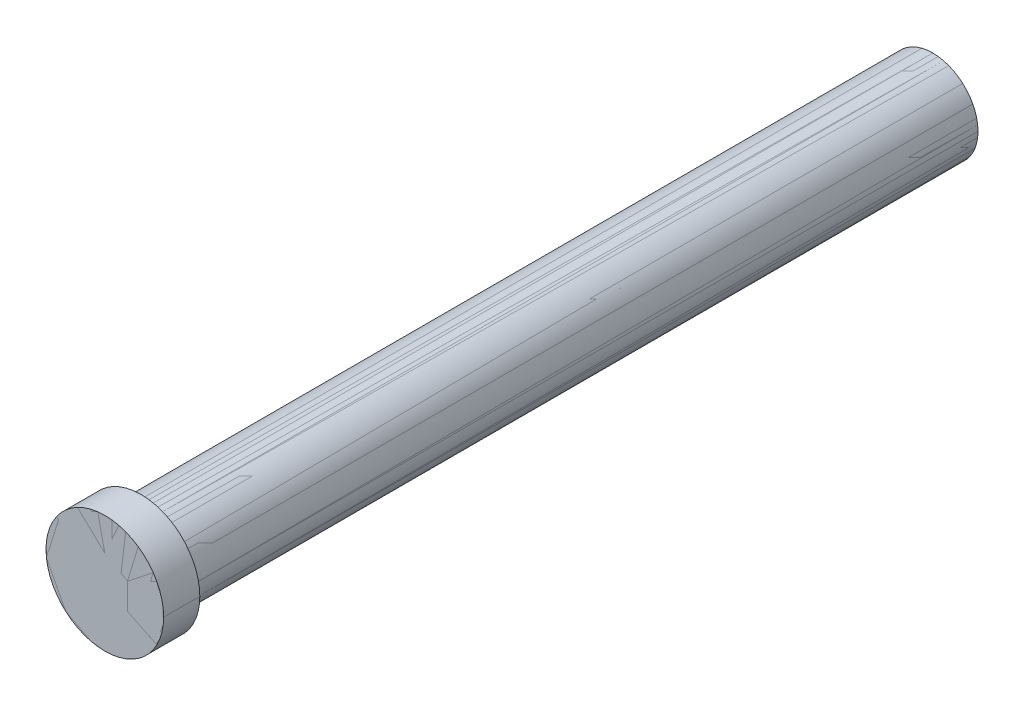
ISO-10303-21;
HEADER;
FILE_DESCRIPTION(('STEP AP214'),'2;1');
FILE_NAME('part.step','',(''),(''),'','','');
FILE_SCHEMA(('AUTOMOTIVE_DESIGN { 1 0 10303 214 1 1 1 1 }'));
ENDSEC;
DATA;
#1=APPLICATION_CONTEXT('core data for automotive mechanical design processes');
#2=APPLICATION_PROTOCOL_DEFINITION('international standard','automotive_design',2000,#1);
#3=PRODUCT_CONTEXT('',#1,'mechanical');
#4=PRODUCT('Part','Part','',(#3));
#5=PRODUCT_RELATED_PRODUCT_CATEGORY('part','',(#4));
#6=PRODUCT_DEFINITION_FORMATION('','',#4);
#7=PRODUCT_DEFINITION_CONTEXT('part definition',#1,'design');
#8=PRODUCT_DEFINITION('design','',#6,#7);
#9=PRODUCT_DEFINITION_SHAPE('','',#8);
#10=(LENGTH_UNIT() NAMED_UNIT(*) SI_UNIT(.MILLI.,.METRE.));
#11=(NAMED_UNIT(*) PLANE_ANGLE_UNIT() SI_UNIT($,.RADIAN.));
#12=(NAMED_UNIT(*) SI_UNIT($,.STERADIAN.) SOLID_ANGLE_UNIT());
#13=UNCERTAINTY_MEASURE_WITH_UNIT(LENGTH_MEASURE(1.E-05),#10,'distance_accuracy_value','');
#14=(GEOMETRIC_REPRESENTATION_CONTEXT(3) GLOBAL_UNCERTAINTY_ASSIGNED_CONTEXT((#13)) GLOBAL_UNIT_ASSIGNED_CONTEXT((#10,
#11,#12)) REPRESENTATION_CONTEXT('',''));
#15=CARTESIAN_POINT('',(0.,0.,0.));
#16=DIRECTION('',(0.,0.,1.));
#17=DIRECTION('',(1.,0.,0.));
#18=AXIS2_PLACEMENT_3D('',#15,#16,#17);
#19=CARTESIAN_POINT('',(0.,0.,-16.));
#20=DIRECTION('',(0.,0.,1.));
#21=DIRECTION('',(1.,0.,0.));
#22=AXIS2_PLACEMENT_3D('',#19,#20,#21);
#23=CYLINDRICAL_SURFACE('',#22,6.172);
#24=CARTESIAN_POINT('',(0.,0.,-175.));
#25=DIRECTION('',(0.,0.,1.));
#26=DIRECTION('',(1.,0.,0.));
#27=AXIS2_PLACEMENT_3D('',#24,#25,#26);
#28=CIRCLE('',#27,6.172);
#29=CARTESIAN_POINT('',(-6.172,0.,-175.));
#30=VERTEX_POINT('',#29);
#31=CARTESIAN_POINT('',(6.172,0.,-175.));
#32=VERTEX_POINT('',#31);
#33=EDGE_CURVE('P0_E20',#30,#32,#28,.T.);
#34=ORIENTED_EDGE('',*,*,#33,.F.);
#35=DIRECTION('',(0.,0.,1.));
#36=VECTOR('',#35,1.);
#37=CARTESIAN_POINT('',(-6.172,0.,-16.));
#38=LINE('',#37,#36);
#39=CARTESIAN_POINT('',(-6.172,0.,-150.));
#40=VERTEX_POINT('',#39);
#41=EDGE_CURVE('P0_E10',#30,#40,#38,.T.);
#42=ORIENTED_EDGE('',*,*,#41,.T.);
#43=CARTESIAN_POINT('',(0.,0.,-150.));
#44=DIRECTION('',(0.,0.,1.));
#45=DIRECTION('',(1.,0.,0.));
#46=AXIS2_PLACEMENT_3D('',#43,#44,#45);
#47=CIRCLE('',#46,6.172);
#48=CARTESIAN_POINT('',(6.172,0.,-150.));
#49=VERTEX_POINT('',#48);
#50=EDGE_CURVE('P0_E27',#40,#49,#47,.T.);
#51=ORIENTED_EDGE('',*,*,#50,.T.);
#52=DIRECTION('',(0.,0.,1.));
#53=VECTOR('',#52,1.);
#54=CARTESIAN_POINT('',(6.172,0.,-16.));
#55=LINE('',#54,#53);
#56=EDGE_CURVE('P0_E98',#32,#49,#55,.T.);
#57=ORIENTED_EDGE('',*,*,#56,.F.);
#58=EDGE_LOOP('',(#34,#42,#51,#57));
#59=FACE_BOUND('',#58,.T.);
#60=ADVANCED_FACE('P0_F16',(#59),#23,.F.);
#61=CARTESIAN_POINT('',(0.,0.,-16.));
#62=DIRECTION('',(0.,0.,1.));
#63=DIRECTION('',(1.,0.,0.));
#64=AXIS2_PLACEMENT_3D('',#61,#62,#63);
#65=CYLINDRICAL_SURFACE('',#64,7.);
#66=CARTESIAN_POINT('',(0.,0.,-175.));
#67=DIRECTION('',(0.,0.,1.));
#68=DIRECTION('',(1.,0.,0.));
#69=AXIS2_PLACEMENT_3D('',#66,#67,#68);
#70=CIRCLE('',#69,7.);
#71=CARTESIAN_POINT('',(7.,0.,-175.));
#72=VERTEX_POINT('',#71);
#73=CARTESIAN_POINT('',(-7.,0.,-175.));
#74=VERTEX_POINT('',#73);
#75=EDGE_CURVE('P0_E80',#72,#74,#70,.T.);
#76=ORIENTED_EDGE('',*,*,#75,.T.);
#77=DIRECTION('',(0.,0.,1.));
#78=VECTOR('',#77,1.);
#79=CARTESIAN_POINT('',(-7.,0.,-16.));
#80=LINE('',#79,#78);
#81=CARTESIAN_POINT('',(-7.,0.,-150.));
#82=VERTEX_POINT('',#81);
#83=EDGE_CURVE('P0_E69',#74,#82,#80,.T.);
#84=ORIENTED_EDGE('',*,*,#83,.T.);
#85=CARTESIAN_POINT('',(0.,0.,-150.));
#86=DIRECTION('',(0.,0.,1.));
#87=DIRECTION('',(1.,0.,0.));
#88=AXIS2_PLACEMENT_3D('',#85,#86,#87);
#89=CIRCLE('',#88,7.);
#90=CARTESIAN_POINT('',(7.,0.,-150.));
#91=VERTEX_POINT('',#90);
#92=EDGE_CURVE('P0_E94',#91,#82,#89,.T.);
#93=ORIENTED_EDGE('',*,*,#92,.F.);
#94=DIRECTION('',(0.,0.,1.));
#95=VECTOR('',#94,1.);
#96=CARTESIAN_POINT('',(7.,0.,-16.));
#97=LINE('',#96,#95);
#98=EDGE_CURVE('P0_E84',#72,#91,#97,.T.);
#99=ORIENTED_EDGE('',*,*,#98,.F.);
#100=EDGE_LOOP('',(#76,#84,#93,#99));
#101=FACE_BOUND('',#100,.T.);
#102=ADVANCED_FACE('P0_F83',(#101),#65,.T.);
#103=CARTESIAN_POINT('',(0.,0.,-16.));
#104=DIRECTION('',(0.,0.,1.));
#105=DIRECTION('',(1.,0.,0.));
#106=AXIS2_PLACEMENT_3D('',#103,#104,#105);
#107=CYLINDRICAL_SURFACE('',#106,7.);
#108=ORIENTED_EDGE('',*,*,#83,.F.);
#109=CARTESIAN_POINT('',(0.,0.,-175.));
#110=DIRECTION('',(0.,0.,1.));
#111=DIRECTION('',(1.,0.,0.));
#112=AXIS2_PLACEMENT_3D('',#109,#110,#111);
#113=CIRCLE('',#112,7.);
#114=EDGE_CURVE('P0_E74',#74,#72,#113,.T.);
#115=ORIENTED_EDGE('',*,*,#114,.T.);
#116=ORIENTED_EDGE('',*,*,#98,.T.);
#117=CARTESIAN_POINT('',(0.,0.,-150.));
#118=DIRECTION('',(0.,0.,1.));
#119=DIRECTION('',(1.,0.,0.));
#120=AXIS2_PLACEMENT_3D('',#117,#118,#119);
#121=CIRCLE('',#120,7.);
#122=EDGE_CURVE('P0_E76',#82,#91,#121,.T.);
#123=ORIENTED_EDGE('',*,*,#122,.F.);
#124=EDGE_LOOP('',(#108,#115,#116,#123));
#125=FACE_BOUND('',#124,.T.);
#126=ADVANCED_FACE('P0_F71',(#125),#107,.T.);
#127=CARTESIAN_POINT('',(0.,7.,-150.));
#128=DIRECTION('',(0.,0.,-1.));
#129=DIRECTION('',(0.,-1.,0.));
#130=AXIS2_PLACEMENT_3D('',#127,#128,#129);
#131=PLANE('',#130);
#132=ORIENTED_EDGE('',*,*,#92,.T.);
#133=ORIENTED_EDGE('',*,*,#122,.T.);
#134=EDGE_LOOP('',(#132,#133));
#135=FACE_BOUND('',#134,.T.);
#136=CARTESIAN_POINT('',(0.,0.,-150.));
#137=DIRECTION('',(0.,0.,1.));
#138=DIRECTION('',(1.,0.,0.));
#139=AXIS2_PLACEMENT_3D('',#136,#137,#138);
#140=CIRCLE('',#139,6.172);
#141=EDGE_CURVE('P0_E103',#49,#40,#140,.T.);
#142=ORIENTED_EDGE('',*,*,#141,.F.);
#143=ORIENTED_EDGE('',*,*,#50,.F.);
#144=EDGE_LOOP('',(#142,#143));
#145=FACE_BOUND('',#144,.T.);
#146=ADVANCED_FACE('P0_F119',(#135,#145),#131,.F.);
#147=CARTESIAN_POINT('',(0.,0.,-16.));
#148=DIRECTION('',(0.,0.,1.));
#149=DIRECTION('',(1.,0.,0.));
#150=AXIS2_PLACEMENT_3D('',#147,#148,#149);
#151=CYLINDRICAL_SURFACE('',#150,6.172);
#152=ORIENTED_EDGE('',*,*,#41,.F.);
#153=CARTESIAN_POINT('',(0.,0.,-175.));
#154=DIRECTION('',(0.,0.,1.));
#155=DIRECTION('',(1.,0.,0.));
#156=AXIS2_PLACEMENT_3D('',#153,#154,#155);
#157=CIRCLE('',#156,6.172);
#158=EDGE_CURVE('P0_E100',#32,#30,#157,.T.);
#159=ORIENTED_EDGE('',*,*,#158,.F.);
#160=ORIENTED_EDGE('',*,*,#56,.T.);
#161=ORIENTED_EDGE('',*,*,#141,.T.);
#162=EDGE_LOOP('',(#152,#159,#160,#161));
#163=FACE_BOUND('',#162,.T.);
#164=ADVANCED_FACE('P0_F121',(#163),#151,.F.);
#165=CARTESIAN_POINT('',(0.,6.172,-175.));
#166=DIRECTION('',(0.,0.,1.));
#167=DIRECTION('',(1.,0.,0.));
#168=AXIS2_PLACEMENT_3D('',#165,#166,#167);
#169=PLANE('',#168);
#170=ORIENTED_EDGE('',*,*,#75,.F.);
#171=ORIENTED_EDGE('',*,*,#114,.F.);
#172=EDGE_LOOP('',(#170,#171));
#173=FACE_BOUND('',#172,.T.);
#174=ORIENTED_EDGE('',*,*,#158,.T.);
#175=ORIENTED_EDGE('',*,*,#33,.T.);
#176=EDGE_LOOP('',(#174,#175));
#177=FACE_BOUND('',#176,.T.);
#178=ADVANCED_FACE('P0_F18',(#173,#177),#169,.F.);
#179=CLOSED_SHELL('',(#60,#102,#126,#146,#164,#178));
#180=MANIFOLD_SOLID_BREP('P0_B1',#179);
#181=CARTESIAN_POINT('',(0.,0.,8.));
#182=DIRECTION('',(0.,0.,1.));
#183=DIRECTION('',(1.,0.,0.));
#184=AXIS2_PLACEMENT_3D('',#181,#182,#183);
#185=CYLINDRICAL_SURFACE('',#184,6.99999998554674);
#186=CARTESIAN_POINT('',(0.,0.,-175.000000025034));
#187=DIRECTION('',(0.,0.,1.));
#188=DIRECTION('',(1.,0.,0.));
#189=AXIS2_PLACEMENT_3D('',#186,#187,#188);
#190=CIRCLE('',#189,6.99999998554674);
#191=CARTESIAN_POINT('',(-6.99999998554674,0.,-175.000000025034));
#192=VERTEX_POINT('',#191);
#193=CARTESIAN_POINT('',(6.99999998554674,0.,-175.000000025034));
#194=VERTEX_POINT('',#193);
#195=EDGE_CURVE('P1_E42',#192,#194,#190,.T.);
#196=ORIENTED_EDGE('',*,*,#195,.F.);
#197=DIRECTION('',(0.,0.,1.));
#198=VECTOR('',#197,1.);
#199=CARTESIAN_POINT('',(-6.99999998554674,0.,8.));
#200=LINE('',#199,#198);
#201=CARTESIAN_POINT('',(-6.99999998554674,0.,-150.000000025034));
#202=VERTEX_POINT('',#201);
#203=EDGE_CURVE('P1_E11',#192,#202,#200,.T.);
#204=ORIENTED_EDGE('',*,*,#203,.T.);
#205=CARTESIAN_POINT('',(0.,0.,-150.000000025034));
#206=DIRECTION('',(0.,0.,1.));
#207=DIRECTION('',(1.,0.,0.));
#208=AXIS2_PLACEMENT_3D('',#205,#206,#207);
#209=CIRCLE('',#208,6.99999998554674);
#210=CARTESIAN_POINT('',(6.99999998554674,0.,-150.000000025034));
#211=VERTEX_POINT('',#210);
#212=EDGE_CURVE('P1_E28',#202,#211,#209,.T.);
#213=ORIENTED_EDGE('',*,*,#212,.T.);
#214=DIRECTION('',(0.,0.,1.));
#215=VECTOR('',#214,1.);
#216=CARTESIAN_POINT('',(6.99999998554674,0.,8.));
#217=LINE('',#216,#215);
#218=EDGE_CURVE('P1_E267',#194,#211,#217,.T.);
#219=ORIENTED_EDGE('',*,*,#218,.F.);
#220=EDGE_LOOP('',(#196,#204,#213,#219));
#221=FACE_BOUND('',#220,.T.);
#222=ADVANCED_FACE('P1_F17',(#221),#185,.F.);
#223=CARTESIAN_POINT('',(0.,0.,8.));
#224=DIRECTION('',(0.,0.,1.));
#225=DIRECTION('',(1.,0.,0.));
#226=AXIS2_PLACEMENT_3D('',#223,#224,#225);
#227=CYLINDRICAL_SURFACE('',#226,10.);
#228=CARTESIAN_POINT('',(0.,0.,-175.000000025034));
#229=DIRECTION('',(0.,0.,1.));
#230=DIRECTION('',(1.,0.,0.));
#231=AXIS2_PLACEMENT_3D('',#228,#229,#230);
#232=CIRCLE('',#231,10.);
#233=CARTESIAN_POINT('',(10.,0.,-175.000000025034));
#234=VERTEX_POINT('',#233);
#235=CARTESIAN_POINT('',(-10.,0.,-175.000000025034));
#236=VERTEX_POINT('',#235);
#237=EDGE_CURVE('P1_E165',#234,#236,#232,.T.);
#238=ORIENTED_EDGE('',*,*,#237,.T.);
#239=DIRECTION('',(0.,0.,1.));
#240=VECTOR('',#239,1.);
#241=CARTESIAN_POINT('',(-10.,0.,8.));
#242=LINE('',#241,#240);
#243=CARTESIAN_POINT('',(-10.,0.,0.));
#244=VERTEX_POINT('',#243);
#245=EDGE_CURVE('P1_E147',#236,#244,#242,.T.);
#246=ORIENTED_EDGE('',*,*,#245,.T.);
#247=CARTESIAN_POINT('',(0.,0.,0.));
#248=DIRECTION('',(0.,0.,1.));
#249=DIRECTION('',(1.,0.,0.));
#250=AXIS2_PLACEMENT_3D('',#247,#248,#249);
#251=CIRCLE('',#250,10.);
#252=CARTESIAN_POINT('',(10.,0.,0.));
#253=VERTEX_POINT('',#252);
#254=EDGE_CURVE('P1_E155',#253,#244,#251,.T.);
#255=ORIENTED_EDGE('',*,*,#254,.F.);
#256=DIRECTION('',(0.,0.,1.));
#257=VECTOR('',#256,1.);
#258=CARTESIAN_POINT('',(10.,0.,8.));
#259=LINE('',#258,#257);
#260=EDGE_CURVE('P1_E171',#234,#253,#259,.T.);
#261=ORIENTED_EDGE('',*,*,#260,.F.);
#262=EDGE_LOOP('',(#238,#246,#255,#261));
#263=FACE_BOUND('',#262,.T.);
#264=ADVANCED_FACE('P1_F163',(#263),#227,.T.);
#265=CARTESIAN_POINT('',(0.,0.,8.));
#266=DIRECTION('',(0.,0.,1.));
#267=DIRECTION('',(1.,0.,0.));
#268=AXIS2_PLACEMENT_3D('',#265,#266,#267);
#269=CYLINDRICAL_SURFACE('',#268,13.);
#270=CARTESIAN_POINT('',(0.,0.,0.));
#271=DIRECTION('',(0.,0.,1.));
#272=DIRECTION('',(1.,0.,0.));
#273=AXIS2_PLACEMENT_3D('',#270,#271,#272);
#274=CIRCLE('',#273,13.);
#275=CARTESIAN_POINT('',(13.,0.,0.));
#276=VERTEX_POINT('',#275);
#277=CARTESIAN_POINT('',(-13.,0.,0.));
#278=VERTEX_POINT('',#277);
#279=EDGE_CURVE('P1_E168',#276,#278,#274,.T.);
#280=ORIENTED_EDGE('',*,*,#279,.T.);
#281=DIRECTION('',(0.,0.,1.));
#282=VECTOR('',#281,1.);
#283=CARTESIAN_POINT('',(-13.,0.,8.));
#284=LINE('',#283,#282);
#285=CARTESIAN_POINT('',(-13.,0.,8.));
#286=VERTEX_POINT('',#285);
#287=EDGE_CURVE('P1_E214',#278,#286,#284,.T.);
#288=ORIENTED_EDGE('',*,*,#287,.T.);
#289=CARTESIAN_POINT('',(0.,0.,8.));
#290=DIRECTION('',(0.,0.,1.));
#291=DIRECTION('',(1.,0.,0.));
#292=AXIS2_PLACEMENT_3D('',#289,#290,#291);
#293=CIRCLE('',#292,13.);
#294=CARTESIAN_POINT('',(13.,0.,8.));
#295=VERTEX_POINT('',#294);
#296=EDGE_CURVE('P1_E206',#295,#286,#293,.T.);
#297=ORIENTED_EDGE('',*,*,#296,.F.);
#298=DIRECTION('',(0.,0.,1.));
#299=VECTOR('',#298,1.);
#300=CARTESIAN_POINT('',(13.,0.,8.));
#301=LINE('',#300,#299);
#302=EDGE_CURVE('P1_E161',#276,#295,#301,.T.);
#303=ORIENTED_EDGE('',*,*,#302,.F.);
#304=EDGE_LOOP('',(#280,#288,#297,#303));
#305=FACE_BOUND('',#304,.T.);
#306=ADVANCED_FACE('P1_F19',(#305),#269,.T.);
#307=CARTESIAN_POINT('',(0.,0.,-1143.43659417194));
#308=DIRECTION('',(0.,0.,-1.));
#309=DIRECTION('',(-1.,0.,0.));
#310=AXIS2_PLACEMENT_3D('',#307,#308,#309);
#311=CONICAL_SURFACE('',#310,1732.05080756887,1.0471975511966);
#312=DIRECTION('',(-0.866025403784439,0.,-0.5));
#313=VECTOR('',#312,1.);
#314=CARTESIAN_POINT('',(0.,0.,-143.43659417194));
#315=LINE('',#314,#313);
#316=CARTESIAN_POINT('',(0.,0.,-143.43659417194));
#317=VERTEX_POINT('',#316);
#318=CARTESIAN_POINT('',(-6.17199998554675,0.,-147.000000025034));
#319=VERTEX_POINT('',#318);
#320=EDGE_CURVE('P1_E220',#317,#319,#315,.T.);
#321=ORIENTED_EDGE('',*,*,#320,.F.);
#322=DIRECTION('',(0.866025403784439,0.,-0.5));
#323=VECTOR('',#322,1.);
#324=CARTESIAN_POINT('',(0.,0.,-143.43659417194));
#325=LINE('',#324,#323);
#326=CARTESIAN_POINT('',(6.17199998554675,0.,-147.000000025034));
#327=VERTEX_POINT('',#326);
#328=EDGE_CURVE('P1_E200',#317,#327,#325,.T.);
#329=ORIENTED_EDGE('',*,*,#328,.T.);
#330=CARTESIAN_POINT('',(0.,0.,-147.000000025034));
#331=DIRECTION('',(0.,0.,1.));
#332=DIRECTION('',(1.,0.,0.));
#333=AXIS2_PLACEMENT_3D('',#330,#331,#332);
#334=CIRCLE('',#333,6.17199998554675);
#335=EDGE_CURVE('P1_E201',#319,#327,#334,.T.);
#336=ORIENTED_EDGE('',*,*,#335,.F.);
#337=EDGE_LOOP('',(#321,#329,#336));
#338=FACE_BOUND('',#337,.T.);
#339=ADVANCED_FACE('P1_F588',(#338),#311,.F.);
#340=CARTESIAN_POINT('',(0.,0.,8.));
#341=DIRECTION('',(0.,0.,1.));
#342=DIRECTION('',(1.,0.,0.));
#343=AXIS2_PLACEMENT_3D('',#340,#341,#342);
#344=CYLINDRICAL_SURFACE('',#343,6.17199998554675);
#345=CARTESIAN_POINT('',(0.,0.,-150.000000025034));
#346=DIRECTION('',(0.,0.,1.));
#347=DIRECTION('',(1.,0.,0.));
#348=AXIS2_PLACEMENT_3D('',#345,#346,#347);
#349=CIRCLE('',#348,6.17199998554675);
#350=CARTESIAN_POINT('',(-6.17199998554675,0.,-150.000000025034));
#351=VERTEX_POINT('',#350);
#352=CARTESIAN_POINT('',(6.17199998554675,0.,-150.000000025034));
#353=VERTEX_POINT('',#352);
#354=EDGE_CURVE('P1_E262',#351,#353,#349,.T.);
#355=ORIENTED_EDGE('',*,*,#354,.F.);
#356=DIRECTION('',(0.,0.,1.));
#357=VECTOR('',#356,1.);
#358=CARTESIAN_POINT('',(-6.17199998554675,0.,8.));
#359=LINE('',#358,#357);
#360=EDGE_CURVE('P1_E196',#351,#319,#359,.T.);
#361=ORIENTED_EDGE('',*,*,#360,.T.);
#362=ORIENTED_EDGE('',*,*,#335,.T.);
#363=DIRECTION('',(0.,0.,1.));
#364=VECTOR('',#363,1.);
#365=CARTESIAN_POINT('',(6.17199998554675,0.,8.));
#366=LINE('',#365,#364);
#367=EDGE_CURVE('P1_E255',#353,#327,#366,.T.);
#368=ORIENTED_EDGE('',*,*,#367,.F.);
#369=EDGE_LOOP('',(#355,#361,#362,#368));
#370=FACE_BOUND('',#369,.T.);
#371=ADVANCED_FACE('P1_F300',(#370),#344,.F.);
#372=CARTESIAN_POINT('',(13.,0.,8.));
#373=DIRECTION('',(0.,0.,-1.));
#374=DIRECTION('',(0.,-1.,0.));
#375=AXIS2_PLACEMENT_3D('',#372,#373,#374);
#376=PLANE('',#375);
#377=ORIENTED_EDGE('',*,*,#296,.T.);
#378=CARTESIAN_POINT('',(0.,0.,8.));
#379=DIRECTION('',(0.,0.,1.));
#380=DIRECTION('',(1.,0.,0.));
#381=AXIS2_PLACEMENT_3D('',#378,#379,#380);
#382=CIRCLE('',#381,13.);
#383=EDGE_CURVE('P1_E202',#286,#295,#382,.T.);
#384=ORIENTED_EDGE('',*,*,#383,.T.);
#385=EDGE_LOOP('',(#377,#384));
#386=FACE_BOUND('',#385,.T.);
#387=DIRECTION('',(-0.866025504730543,-0.499999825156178,0.));
#388=VECTOR('',#387,1.);
#389=CARTESIAN_POINT('',(7.2500040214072,9.95928982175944,8.));
#390=LINE('',#389,#388);
#391=CARTESIAN_POINT('',(0.,5.7735,8.));
#392=VERTEX_POINT('',#391);
#393=CARTESIAN_POINT('',(-5.,2.88675,8.));
#394=VERTEX_POINT('',#393);
#395=EDGE_CURVE('P1_E268',#392,#394,#390,.T.);
#396=ORIENTED_EDGE('',*,*,#395,.F.);
#397=DIRECTION('',(-0.866025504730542,0.499999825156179,0.));
#398=VECTOR('',#397,1.);
#399=CARTESIAN_POINT('',(12.2500005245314,-1.29903780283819,8.));
#400=LINE('',#399,#398);
#401=CARTESIAN_POINT('',(5.,2.88675,8.));
#402=VERTEX_POINT('',#401);
#403=EDGE_CURVE('P1_E192',#402,#392,#400,.T.);
#404=ORIENTED_EDGE('',*,*,#403,.F.);
#405=DIRECTION('',(0.,1.,0.));
#406=VECTOR('',#405,1.);
#407=CARTESIAN_POINT('',(5.,0.,8.));
#408=LINE('',#407,#406);
#409=CARTESIAN_POINT('',(5.,-2.88675,8.));
#410=VERTEX_POINT('',#409);
#411=EDGE_CURVE('P1_E233',#410,#402,#408,.T.);
#412=ORIENTED_EDGE('',*,*,#411,.F.);
#413=DIRECTION('',(0.866025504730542,0.49999982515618,0.));
#414=VECTOR('',#413,1.);
#415=CARTESIAN_POINT('',(12.2500005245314,1.2990378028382,8.));
#416=LINE('',#415,#414);
#417=CARTESIAN_POINT('',(0.,-5.7735,8.));
#418=VERTEX_POINT('',#417);
#419=EDGE_CURVE('P1_E242',#418,#410,#416,.T.);
#420=ORIENTED_EDGE('',*,*,#419,.F.);
#421=DIRECTION('',(0.866025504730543,-0.499999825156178,0.));
#422=VECTOR('',#421,1.);
#423=CARTESIAN_POINT('',(7.2500040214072,-9.95928982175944,8.));
#424=LINE('',#423,#422);
#425=CARTESIAN_POINT('',(-4.99999650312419,-2.88675201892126,8.));
#426=VERTEX_POINT('',#425);
#427=EDGE_CURVE('P1_E191',#426,#418,#424,.T.);
#428=ORIENTED_EDGE('',*,*,#427,.F.);
#429=DIRECTION('',(6.05676728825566E-07,-0.999999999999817,0.));
#430=VECTOR('',#429,1.);
#431=CARTESIAN_POINT('',(-4.99999825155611,-1.09021800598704E-05,8.));
#432=LINE('',#431,#430);
#433=EDGE_CURVE('P1_E256',#394,#426,#432,.T.);
#434=ORIENTED_EDGE('',*,*,#433,.F.);
#435=EDGE_LOOP('',(#396,#404,#412,#420,#428,#434));
#436=FACE_BOUND('',#435,.T.);
#437=ADVANCED_FACE('P1_F587',(#386,#436),#376,.F.);
#438=CARTESIAN_POINT('',(6.17199998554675,0.,-150.000000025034));
#439=DIRECTION('',(0.,0.,1.));
#440=DIRECTION('',(1.,0.,0.));
#441=AXIS2_PLACEMENT_3D('',#438,#439,#440);
#442=PLANE('',#441);
#443=CARTESIAN_POINT('',(0.,0.,-150.000000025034));
#444=DIRECTION('',(0.,0.,1.));
#445=DIRECTION('',(1.,0.,0.));
#446=AXIS2_PLACEMENT_3D('',#443,#444,#445);
#447=CIRCLE('',#446,6.99999998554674);
#448=EDGE_CURVE('P1_E263',#211,#202,#447,.T.);
#449=ORIENTED_EDGE('',*,*,#448,.F.);
#450=ORIENTED_EDGE('',*,*,#212,.F.);
#451=EDGE_LOOP('',(#449,#450));
#452=FACE_BOUND('',#451,.T.);
#453=CARTESIAN_POINT('',(0.,0.,-150.000000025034));
#454=DIRECTION('',(0.,0.,1.));
#455=DIRECTION('',(1.,0.,0.));
#456=AXIS2_PLACEMENT_3D('',#453,#454,#455);
#457=CIRCLE('',#456,6.17199998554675);
#458=EDGE_CURVE('P1_E207',#353,#351,#457,.T.);
#459=ORIENTED_EDGE('',*,*,#458,.T.);
#460=ORIENTED_EDGE('',*,*,#354,.T.);
#461=EDGE_LOOP('',(#459,#460));
#462=FACE_BOUND('',#461,.T.);
#463=ADVANCED_FACE('P1_F292',(#452,#462),#442,.F.);
#464=CARTESIAN_POINT('',(0.,0.,8.));
#465=DIRECTION('',(0.,0.,1.));
#466=DIRECTION('',(1.,0.,0.));
#467=AXIS2_PLACEMENT_3D('',#464,#465,#466);
#468=CYLINDRICAL_SURFACE('',#467,6.17199998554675);
#469=ORIENTED_EDGE('',*,*,#360,.F.);
#470=ORIENTED_EDGE('',*,*,#458,.F.);
#471=ORIENTED_EDGE('',*,*,#367,.T.);
#472=CARTESIAN_POINT('',(0.,0.,-147.000000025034));
#473=DIRECTION('',(0.,0.,1.));
#474=DIRECTION('',(1.,0.,0.));
#475=AXIS2_PLACEMENT_3D('',#472,#473,#474);
#476=CIRCLE('',#475,6.17199998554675);
#477=EDGE_CURVE('P1_E223',#327,#319,#476,.T.);
#478=ORIENTED_EDGE('',*,*,#477,.T.);
#479=EDGE_LOOP('',(#469,#470,#471,#478));
#480=FACE_BOUND('',#479,.T.);
#481=ADVANCED_FACE('P1_F296',(#480),#468,.F.);
#482=CARTESIAN_POINT('',(0.,0.,-1143.43659417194));
#483=DIRECTION('',(0.,0.,-1.));
#484=DIRECTION('',(-1.,0.,0.));
#485=AXIS2_PLACEMENT_3D('',#482,#483,#484);
#486=CONICAL_SURFACE('',#485,1732.05080756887,1.0471975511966);
#487=ORIENTED_EDGE('',*,*,#328,.F.);
#488=ORIENTED_EDGE('',*,*,#320,.T.);
#489=ORIENTED_EDGE('',*,*,#477,.F.);
#490=EDGE_LOOP('',(#487,#488,#489));
#491=FACE_BOUND('',#490,.T.);
#492=ADVANCED_FACE('P1_F677',(#491),#486,.F.);
#493=CARTESIAN_POINT('',(0.,0.,8.));
#494=DIRECTION('',(0.,0.,1.));
#495=DIRECTION('',(1.,0.,0.));
#496=AXIS2_PLACEMENT_3D('',#493,#494,#495);
#497=CYLINDRICAL_SURFACE('',#496,13.);
#498=ORIENTED_EDGE('',*,*,#287,.F.);
#499=CARTESIAN_POINT('',(0.,0.,0.));
#500=DIRECTION('',(0.,0.,1.));
#501=DIRECTION('',(1.,0.,0.));
#502=AXIS2_PLACEMENT_3D('',#499,#500,#501);
#503=CIRCLE('',#502,13.);
#504=EDGE_CURVE('P1_E224',#278,#276,#503,.T.);
#505=ORIENTED_EDGE('',*,*,#504,.T.);
#506=ORIENTED_EDGE('',*,*,#302,.T.);
#507=ORIENTED_EDGE('',*,*,#383,.F.);
#508=EDGE_LOOP('',(#498,#505,#506,#507));
#509=FACE_BOUND('',#508,.T.);
#510=ADVANCED_FACE('P1_F688',(#509),#497,.T.);
#511=CARTESIAN_POINT('',(10.,0.,0.));
#512=DIRECTION('',(0.,0.,1.));
#513=DIRECTION('',(1.,0.,0.));
#514=AXIS2_PLACEMENT_3D('',#511,#512,#513);
#515=PLANE('',#514);
#516=ORIENTED_EDGE('',*,*,#279,.F.);
#517=ORIENTED_EDGE('',*,*,#504,.F.);
#518=EDGE_LOOP('',(#516,#517));
#519=FACE_BOUND('',#518,.T.);
#520=ORIENTED_EDGE('',*,*,#254,.T.);
#521=CARTESIAN_POINT('',(0.,0.,0.));
#522=DIRECTION('',(0.,0.,1.));
#523=DIRECTION('',(1.,0.,0.));
#524=AXIS2_PLACEMENT_3D('',#521,#522,#523);
#525=CIRCLE('',#524,10.);
#526=EDGE_CURVE('P1_E157',#244,#253,#525,.T.);
#527=ORIENTED_EDGE('',*,*,#526,.T.);
#528=EDGE_LOOP('',(#520,#527));
#529=FACE_BOUND('',#528,.T.);
#530=ADVANCED_FACE('P1_F156',(#519,#529),#515,.F.);
#531=CARTESIAN_POINT('',(0.,0.,8.));
#532=DIRECTION('',(0.,0.,1.));
#533=DIRECTION('',(1.,0.,0.));
#534=AXIS2_PLACEMENT_3D('',#531,#532,#533);
#535=CYLINDRICAL_SURFACE('',#534,10.);
#536=ORIENTED_EDGE('',*,*,#245,.F.);
#537=CARTESIAN_POINT('',(0.,0.,-175.000000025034));
#538=DIRECTION('',(0.,0.,1.));
#539=DIRECTION('',(1.,0.,0.));
#540=AXIS2_PLACEMENT_3D('',#537,#538,#539);
#541=CIRCLE('',#540,10.);
#542=EDGE_CURVE('P1_E173',#236,#234,#541,.T.);
#543=ORIENTED_EDGE('',*,*,#542,.T.);
#544=ORIENTED_EDGE('',*,*,#260,.T.);
#545=ORIENTED_EDGE('',*,*,#526,.F.);
#546=EDGE_LOOP('',(#536,#543,#544,#545));
#547=FACE_BOUND('',#546,.T.);
#548=ADVANCED_FACE('P1_F170',(#547),#535,.T.);
#549=CARTESIAN_POINT('',(6.99999998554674,0.,-175.000000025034));
#550=DIRECTION('',(0.,0.,1.));
#551=DIRECTION('',(1.,0.,0.));
#552=AXIS2_PLACEMENT_3D('',#549,#550,#551);
#553=PLANE('',#552);
#554=ORIENTED_EDGE('',*,*,#237,.F.);
#555=ORIENTED_EDGE('',*,*,#542,.F.);
#556=EDGE_LOOP('',(#554,#555));
#557=FACE_BOUND('',#556,.T.);
#558=CARTESIAN_POINT('',(0.,0.,-175.000000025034));
#559=DIRECTION('',(0.,0.,1.));
#560=DIRECTION('',(1.,0.,0.));
#561=AXIS2_PLACEMENT_3D('',#558,#559,#560);
#562=CIRCLE('',#561,6.99999998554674);
#563=EDGE_CURVE('P1_E182',#194,#192,#562,.T.);
#564=ORIENTED_EDGE('',*,*,#563,.T.);
#565=ORIENTED_EDGE('',*,*,#195,.T.);
#566=EDGE_LOOP('',(#564,#565));
#567=FACE_BOUND('',#566,.T.);
#568=ADVANCED_FACE('P1_F634',(#557,#567),#553,.F.);
#569=CARTESIAN_POINT('',(0.,0.,8.));
#570=DIRECTION('',(0.,0.,1.));
#571=DIRECTION('',(1.,0.,0.));
#572=AXIS2_PLACEMENT_3D('',#569,#570,#571);
#573=CYLINDRICAL_SURFACE('',#572,6.99999998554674);
#574=ORIENTED_EDGE('',*,*,#203,.F.);
#575=ORIENTED_EDGE('',*,*,#563,.F.);
#576=ORIENTED_EDGE('',*,*,#218,.T.);
#577=ORIENTED_EDGE('',*,*,#448,.T.);
#578=EDGE_LOOP('',(#574,#575,#576,#577));
#579=FACE_BOUND('',#578,.T.);
#580=ADVANCED_FACE('P1_F655',(#579),#573,.F.);
#581=CARTESIAN_POINT('',(-5.,2.88675,2.99999999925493));
#582=DIRECTION('',(0.499999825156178,-0.866025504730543,0.));
#583=DIRECTION('',(0.,0.,-1.));
#584=AXIS2_PLACEMENT_3D('',#581,#582,#583);
#585=PLANE('',#584);
#586=ORIENTED_EDGE('',*,*,#395,.T.);
#587=DIRECTION('',(0.,0.,1.));
#588=VECTOR('',#587,1.);
#589=CARTESIAN_POINT('',(-5.,2.88675,2.99999999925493));
#590=LINE('',#589,#588);
#591=CARTESIAN_POINT('',(-5.,2.88675,2.99999999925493));
#592=VERTEX_POINT('',#591);
#593=EDGE_CURVE('P1_E96',#592,#394,#590,.T.);
#594=ORIENTED_EDGE('',*,*,#593,.F.);
#595=DIRECTION('',(0.866025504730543,0.499999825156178,0.));
#596=VECTOR('',#595,1.);
#597=CARTESIAN_POINT('',(-5.,2.88675,2.99999999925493));
#598=LINE('',#597,#596);
#599=CARTESIAN_POINT('',(0.,5.7735,2.99999999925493));
#600=VERTEX_POINT('',#599);
#601=EDGE_CURVE('P1_E485',#592,#600,#598,.T.);
#602=ORIENTED_EDGE('',*,*,#601,.T.);
#603=DIRECTION('',(0.,0.,1.));
#604=VECTOR('',#603,1.);
#605=CARTESIAN_POINT('',(0.,5.7735,2.99999999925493));
#606=LINE('',#605,#604);
#607=EDGE_CURVE('P1_E113',#600,#392,#606,.T.);
#608=ORIENTED_EDGE('',*,*,#607,.T.);
#609=EDGE_LOOP('',(#586,#594,#602,#608));
#610=FACE_BOUND('',#609,.T.);
#611=ADVANCED_FACE('P1_F700',(#610),#585,.T.);
#612=CARTESIAN_POINT('',(0.,5.7735,2.99999999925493));
#613=DIRECTION('',(-0.499999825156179,-0.866025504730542,0.));
#614=DIRECTION('',(-0.866025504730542,0.499999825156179,0.));
#615=AXIS2_PLACEMENT_3D('',#612,#613,#614);
#616=PLANE('',#615);
#617=ORIENTED_EDGE('',*,*,#403,.T.);
#618=ORIENTED_EDGE('',*,*,#607,.F.);
#619=DIRECTION('',(0.866025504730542,-0.499999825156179,0.));
#620=VECTOR('',#619,1.);
#621=CARTESIAN_POINT('',(0.,5.7735,2.99999999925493));
#622=LINE('',#621,#620);
#623=CARTESIAN_POINT('',(5.,2.88675,2.99999999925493));
#624=VERTEX_POINT('',#623);
#625=EDGE_CURVE('P1_E195',#600,#624,#622,.T.);
#626=ORIENTED_EDGE('',*,*,#625,.T.);
#627=DIRECTION('',(0.,0.,1.));
#628=VECTOR('',#627,1.);
#629=CARTESIAN_POINT('',(5.,2.88675,2.99999999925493));
#630=LINE('',#629,#628);
#631=EDGE_CURVE('P1_E229',#624,#402,#630,.T.);
#632=ORIENTED_EDGE('',*,*,#631,.T.);
#633=EDGE_LOOP('',(#617,#618,#626,#632));
#634=FACE_BOUND('',#633,.T.);
#635=ADVANCED_FACE('P1_F696',(#634),#616,.T.);
#636=CARTESIAN_POINT('',(5.,2.88675,2.99999999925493));
#637=DIRECTION('',(-1.,0.,0.));
#638=DIRECTION('',(0.,0.,1.));
#639=AXIS2_PLACEMENT_3D('',#636,#637,#638);
#640=PLANE('',#639);
#641=ORIENTED_EDGE('',*,*,#411,.T.);
#642=ORIENTED_EDGE('',*,*,#631,.F.);
#643=DIRECTION('',(0.,-1.,0.));
#644=VECTOR('',#643,1.);
#645=CARTESIAN_POINT('',(5.,2.88675,2.99999999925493));
#646=LINE('',#645,#644);
#647=CARTESIAN_POINT('',(5.,-2.88675,2.99999999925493));
#648=VERTEX_POINT('',#647);
#649=EDGE_CURVE('P1_E241',#624,#648,#646,.T.);
#650=ORIENTED_EDGE('',*,*,#649,.T.);
#651=DIRECTION('',(0.,0.,1.));
#652=VECTOR('',#651,1.);
#653=CARTESIAN_POINT('',(5.,-2.88675,2.99999999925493));
#654=LINE('',#653,#652);
#655=EDGE_CURVE('P1_E237',#648,#410,#654,.T.);
#656=ORIENTED_EDGE('',*,*,#655,.T.);
#657=EDGE_LOOP('',(#641,#642,#650,#656));
#658=FACE_BOUND('',#657,.T.);
#659=ADVANCED_FACE('P1_F328',(#658),#640,.T.);
#660=CARTESIAN_POINT('',(5.,-2.88675,2.99999999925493));
#661=DIRECTION('',(-0.49999982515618,0.866025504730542,0.));
#662=DIRECTION('',(0.,0.,1.));
#663=AXIS2_PLACEMENT_3D('',#660,#661,#662);
#664=PLANE('',#663);
#665=ORIENTED_EDGE('',*,*,#419,.T.);
#666=ORIENTED_EDGE('',*,*,#655,.F.);
#667=DIRECTION('',(-0.866025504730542,-0.49999982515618,0.));
#668=VECTOR('',#667,1.);
#669=CARTESIAN_POINT('',(5.,-2.88675,2.99999999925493));
#670=LINE('',#669,#668);
#671=CARTESIAN_POINT('',(0.,-5.7735,2.99999999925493));
#672=VERTEX_POINT('',#671);
#673=EDGE_CURVE('P1_E190',#648,#672,#670,.T.);
#674=ORIENTED_EDGE('',*,*,#673,.T.);
#675=DIRECTION('',(0.,0.,1.));
#676=VECTOR('',#675,1.);
#677=CARTESIAN_POINT('',(0.,-5.7735,2.99999999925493));
#678=LINE('',#677,#676);
#679=EDGE_CURVE('P1_E186',#672,#418,#678,.T.);
#680=ORIENTED_EDGE('',*,*,#679,.T.);
#681=EDGE_LOOP('',(#665,#666,#674,#680));
#682=FACE_BOUND('',#681,.T.);
#683=ADVANCED_FACE('P1_F321',(#682),#664,.T.);
#684=CARTESIAN_POINT('',(0.,-5.7735,2.99999999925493));
#685=DIRECTION('',(0.499999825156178,0.866025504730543,0.));
#686=DIRECTION('',(0.,0.,-1.));
#687=AXIS2_PLACEMENT_3D('',#684,#685,#686);
#688=PLANE('',#687);
#689=ORIENTED_EDGE('',*,*,#427,.T.);
#690=ORIENTED_EDGE('',*,*,#679,.F.);
#691=DIRECTION('',(-0.866025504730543,0.499999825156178,0.));
#692=VECTOR('',#691,1.);
#693=CARTESIAN_POINT('',(0.,-5.7735,2.99999999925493));
#694=LINE('',#693,#692);
#695=CARTESIAN_POINT('',(-4.99999650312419,-2.88675201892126,2.99999999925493));
#696=VERTEX_POINT('',#695);
#697=EDGE_CURVE('P1_E21',#672,#696,#694,.T.);
#698=ORIENTED_EDGE('',*,*,#697,.T.);
#699=DIRECTION('',(0.,0.,1.));
#700=VECTOR('',#699,1.);
#701=CARTESIAN_POINT('',(-4.99999650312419,-2.88675201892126,2.99999999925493));
#702=LINE('',#701,#700);
#703=EDGE_CURVE('P1_E259',#696,#426,#702,.T.);
#704=ORIENTED_EDGE('',*,*,#703,.T.);
#705=EDGE_LOOP('',(#689,#690,#698,#704));
#706=FACE_BOUND('',#705,.T.);
#707=ADVANCED_FACE('P1_F622',(#706),#688,.T.);
#708=CARTESIAN_POINT('',(-4.99999650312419,-2.88675201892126,2.99999999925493));
#709=DIRECTION('',(0.999999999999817,6.05676728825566E-07,0.));
#710=DIRECTION('',(0.,0.,-1.));
#711=AXIS2_PLACEMENT_3D('',#708,#709,#710);
#712=PLANE('',#711);
#713=ORIENTED_EDGE('',*,*,#433,.T.);
#714=ORIENTED_EDGE('',*,*,#703,.F.);
#715=DIRECTION('',(-6.05676728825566E-07,0.999999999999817,0.));
#716=VECTOR('',#715,1.);
#717=CARTESIAN_POINT('',(-4.99999650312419,-2.88675201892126,2.99999999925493));
#718=LINE('',#717,#716);
#719=EDGE_CURVE('P1_E210',#696,#592,#718,.T.);
#720=ORIENTED_EDGE('',*,*,#719,.T.);
#721=ORIENTED_EDGE('',*,*,#593,.T.);
#722=EDGE_LOOP('',(#713,#714,#720,#721));
#723=FACE_BOUND('',#722,.T.);
#724=ADVANCED_FACE('P1_F618',(#723),#712,.T.);
#725=CARTESIAN_POINT('',(0.,0.,2.99999999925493));
#726=DIRECTION('',(0.,0.,1.));
#727=DIRECTION('',(1.,0.,0.));
#728=AXIS2_PLACEMENT_3D('',#725,#726,#727);
#729=PLANE('',#728);
#730=ORIENTED_EDGE('',*,*,#601,.F.);
#731=ORIENTED_EDGE('',*,*,#719,.F.);
#732=ORIENTED_EDGE('',*,*,#697,.F.);
#733=ORIENTED_EDGE('',*,*,#673,.F.);
#734=ORIENTED_EDGE('',*,*,#649,.F.);
#735=ORIENTED_EDGE('',*,*,#625,.F.);
#736=EDGE_LOOP('',(#730,#731,#732,#733,#734,#735));
#737=FACE_BOUND('',#736,.T.);
#738=ADVANCED_FACE('P1_F331',(#737),#729,.T.);
#739=CLOSED_SHELL('',(#222,#264,#306,#339,#371,#437,#463,#481,#492,#510,#530,#548,#568,#580,
#611,#635,#659,#683,#707,#724,#738));
#740=MANIFOLD_SOLID_BREP('P1_B1',#739);
#741=CARTESIAN_POINT('',(0.,0.,8.));
#742=DIRECTION('',(0.,0.,1.));
#743=DIRECTION('',(1.,0.,0.));
#744=AXIS2_PLACEMENT_3D('',#741,#742,#743);
#745=CYLINDRICAL_SURFACE('',#744,13.);
#746=CARTESIAN_POINT('',(0.,0.,0.));
#747=DIRECTION('',(0.,0.,1.));
#748=DIRECTION('',(1.,0.,0.));
#749=AXIS2_PLACEMENT_3D('',#746,#747,#748);
#750=CIRCLE('',#749,13.);
#751=CARTESIAN_POINT('',(13.,0.,0.));
#752=VERTEX_POINT('',#751);
#753=CARTESIAN_POINT('',(-13.,0.,0.));
#754=VERTEX_POINT('',#753);
#755=EDGE_CURVE('P2_E11',#752,#754,#750,.T.);
#756=ORIENTED_EDGE('',*,*,#755,.T.);
#757=DIRECTION('',(0.,0.,1.));
#758=VECTOR('',#757,1.);
#759=CARTESIAN_POINT('',(-13.,0.,8.));
#760=LINE('',#759,#758);
#761=CARTESIAN_POINT('',(-13.,0.,8.));
#762=VERTEX_POINT('',#761);
#763=EDGE_CURVE('P2_E28',#754,#762,#760,.T.);
#764=ORIENTED_EDGE('',*,*,#763,.T.);
#765=CARTESIAN_POINT('',(0.,0.,8.));
#766=DIRECTION('',(0.,0.,1.));
#767=DIRECTION('',(1.,0.,0.));
#768=AXIS2_PLACEMENT_3D('',#765,#766,#767);
#769=CIRCLE('',#768,13.);
#770=CARTESIAN_POINT('',(13.,0.,8.));
#771=VERTEX_POINT('',#770);
#772=EDGE_CURVE('P2_E64',#771,#762,#769,.T.);
#773=ORIENTED_EDGE('',*,*,#772,.F.);
#774=DIRECTION('',(0.,0.,1.));
#775=VECTOR('',#774,1.);
#776=CARTESIAN_POINT('',(13.,0.,8.));
#777=LINE('',#776,#775);
#778=EDGE_CURVE('P2_E61',#752,#771,#777,.T.);
#779=ORIENTED_EDGE('',*,*,#778,.F.);
#780=EDGE_LOOP('',(#756,#764,#773,#779));
#781=FACE_BOUND('',#780,.T.);
#782=ADVANCED_FACE('P2_F17',(#781),#745,.T.);
#783=CARTESIAN_POINT('',(0.,0.,8.));
#784=DIRECTION('',(0.,0.,1.));
#785=DIRECTION('',(1.,0.,0.));
#786=AXIS2_PLACEMENT_3D('',#783,#784,#785);
#787=CYLINDRICAL_SURFACE('',#786,10.);
#788=CARTESIAN_POINT('',(0.,0.,-175.));
#789=DIRECTION('',(0.,0.,1.));
#790=DIRECTION('',(1.,0.,0.));
#791=AXIS2_PLACEMENT_3D('',#788,#789,#790);
#792=CIRCLE('',#791,10.);
#793=CARTESIAN_POINT('',(10.,0.,-175.));
#794=VERTEX_POINT('',#793);
#795=CARTESIAN_POINT('',(-10.,0.,-175.));
#796=VERTEX_POINT('',#795);
#797=EDGE_CURVE('P2_E85',#794,#796,#792,.T.);
#798=ORIENTED_EDGE('',*,*,#797,.T.);
#799=DIRECTION('',(0.,0.,1.));
#800=VECTOR('',#799,1.);
#801=CARTESIAN_POINT('',(-10.,0.,8.));
#802=LINE('',#801,#800);
#803=CARTESIAN_POINT('',(-10.,0.,0.));
#804=VERTEX_POINT('',#803);
#805=EDGE_CURVE('P2_E95',#796,#804,#802,.T.);
#806=ORIENTED_EDGE('',*,*,#805,.T.);
#807=CARTESIAN_POINT('',(0.,0.,0.));
#808=DIRECTION('',(0.,0.,1.));
#809=DIRECTION('',(1.,0.,0.));
#810=AXIS2_PLACEMENT_3D('',#807,#808,#809);
#811=CIRCLE('',#810,10.);
#812=CARTESIAN_POINT('',(10.,0.,0.));
#813=VERTEX_POINT('',#812);
#814=EDGE_CURVE('P2_E79',#813,#804,#811,.T.);
#815=ORIENTED_EDGE('',*,*,#814,.F.);
#816=DIRECTION('',(0.,0.,1.));
#817=VECTOR('',#816,1.);
#818=CARTESIAN_POINT('',(10.,0.,8.));
#819=LINE('',#818,#817);
#820=EDGE_CURVE('P2_E92',#794,#813,#819,.T.);
#821=ORIENTED_EDGE('',*,*,#820,.F.);
#822=EDGE_LOOP('',(#798,#806,#815,#821));
#823=FACE_BOUND('',#822,.T.);
#824=ADVANCED_FACE('P2_F122',(#823),#787,.T.);
#825=CARTESIAN_POINT('',(0.,0.,-175.));
#826=DIRECTION('',(0.,0.,1.));
#827=DIRECTION('',(1.,0.,0.));
#828=AXIS2_PLACEMENT_3D('',#825,#826,#827);
#829=PLANE('',#828);
#830=ORIENTED_EDGE('',*,*,#797,.F.);
#831=CARTESIAN_POINT('',(0.,0.,-175.));
#832=DIRECTION('',(0.,0.,1.));
#833=DIRECTION('',(1.,0.,0.));
#834=AXIS2_PLACEMENT_3D('',#831,#832,#833);
#835=CIRCLE('',#834,10.);
#836=EDGE_CURVE('P2_E82',#796,#794,#835,.T.);
#837=ORIENTED_EDGE('',*,*,#836,.F.);
#838=EDGE_LOOP('',(#830,#837));
#839=FACE_BOUND('',#838,.T.);
#840=ADVANCED_FACE('P2_F120',(#839),#829,.F.);
#841=CARTESIAN_POINT('',(0.,0.,8.));
#842=DIRECTION('',(0.,0.,1.));
#843=DIRECTION('',(1.,0.,0.));
#844=AXIS2_PLACEMENT_3D('',#841,#842,#843);
#845=CYLINDRICAL_SURFACE('',#844,10.);
#846=ORIENTED_EDGE('',*,*,#805,.F.);
#847=ORIENTED_EDGE('',*,*,#836,.T.);
#848=ORIENTED_EDGE('',*,*,#820,.T.);
#849=CARTESIAN_POINT('',(0.,0.,0.));
#850=DIRECTION('',(0.,0.,1.));
#851=DIRECTION('',(1.,0.,0.));
#852=AXIS2_PLACEMENT_3D('',#849,#850,#851);
#853=CIRCLE('',#852,10.);
#854=EDGE_CURVE('P2_E21',#804,#813,#853,.T.);
#855=ORIENTED_EDGE('',*,*,#854,.F.);
#856=EDGE_LOOP('',(#846,#847,#848,#855));
#857=FACE_BOUND('',#856,.T.);
#858=ADVANCED_FACE('P2_F115',(#857),#845,.T.);
#859=CARTESIAN_POINT('',(10.,0.,0.));
#860=DIRECTION('',(0.,0.,1.));
#861=DIRECTION('',(1.,0.,0.));
#862=AXIS2_PLACEMENT_3D('',#859,#860,#861);
#863=PLANE('',#862);
#864=ORIENTED_EDGE('',*,*,#755,.F.);
#865=CARTESIAN_POINT('',(0.,0.,0.));
#866=DIRECTION('',(0.,0.,1.));
#867=DIRECTION('',(1.,0.,0.));
#868=AXIS2_PLACEMENT_3D('',#865,#866,#867);
#869=CIRCLE('',#868,13.);
#870=EDGE_CURVE('P2_E67',#754,#752,#869,.T.);
#871=ORIENTED_EDGE('',*,*,#870,.F.);
#872=EDGE_LOOP('',(#864,#871));
#873=FACE_BOUND('',#872,.T.);
#874=ORIENTED_EDGE('',*,*,#814,.T.);
#875=ORIENTED_EDGE('',*,*,#854,.T.);
#876=EDGE_LOOP('',(#874,#875));
#877=FACE_BOUND('',#876,.T.);
#878=ADVANCED_FACE('P2_F19',(#873,#877),#863,.F.);
#879=CARTESIAN_POINT('',(0.,0.,8.));
#880=DIRECTION('',(0.,0.,1.));
#881=DIRECTION('',(1.,0.,0.));
#882=AXIS2_PLACEMENT_3D('',#879,#880,#881);
#883=CYLINDRICAL_SURFACE('',#882,13.);
#884=ORIENTED_EDGE('',*,*,#763,.F.);
#885=ORIENTED_EDGE('',*,*,#870,.T.);
#886=ORIENTED_EDGE('',*,*,#778,.T.);
#887=CARTESIAN_POINT('',(0.,0.,8.));
#888=DIRECTION('',(0.,0.,1.));
#889=DIRECTION('',(1.,0.,0.));
#890=AXIS2_PLACEMENT_3D('',#887,#888,#889);
#891=CIRCLE('',#890,13.);
#892=EDGE_CURVE('P2_E88',#762,#771,#891,.T.);
#893=ORIENTED_EDGE('',*,*,#892,.F.);
#894=EDGE_LOOP('',(#884,#885,#886,#893));
#895=FACE_BOUND('',#894,.T.);
#896=ADVANCED_FACE('P2_F71',(#895),#883,.T.);
#897=CARTESIAN_POINT('',(13.,0.,8.));
#898=DIRECTION('',(0.,0.,-1.));
#899=DIRECTION('',(0.,-1.,0.));
#900=AXIS2_PLACEMENT_3D('',#897,#898,#899);
#901=PLANE('',#900);
#902=ORIENTED_EDGE('',*,*,#772,.T.);
#903=ORIENTED_EDGE('',*,*,#892,.T.);
#904=EDGE_LOOP('',(#902,#903));
#905=FACE_BOUND('',#904,.T.);
#906=ADVANCED_FACE('P2_F184',(#905),#901,.F.);
#907=CLOSED_SHELL('',(#782,#824,#840,#858,#878,#896,#906));
#908=MANIFOLD_SOLID_BREP('P2_B1',#907);
#909=ADVANCED_BREP_SHAPE_REPRESENTATION('',(#18,#180,#740,#908),#14);
#910=SHAPE_DEFINITION_REPRESENTATION(#9,#909);
ENDSEC;
END-ISO-10303-21;
